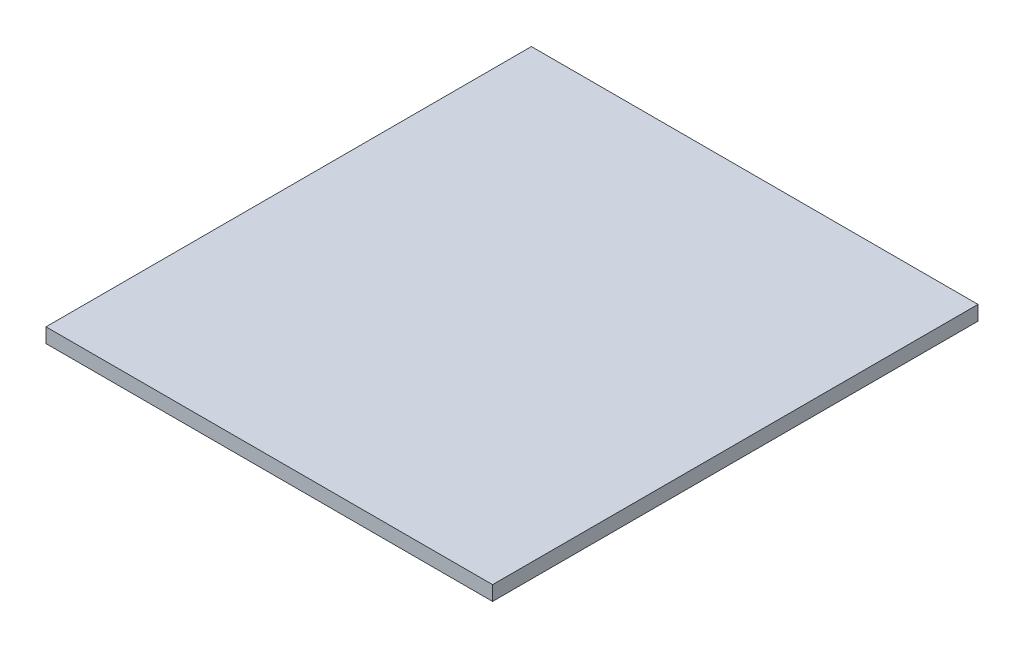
ISO-10303-21;
HEADER;
FILE_DESCRIPTION(('STEP AP214'),'2;1');
FILE_NAME('part.step','',(''),(''),'','','');
FILE_SCHEMA(('AUTOMOTIVE_DESIGN { 1 0 10303 214 1 1 1 1 }'));
ENDSEC;
DATA;
#1=APPLICATION_CONTEXT('core data for automotive mechanical design processes');
#2=APPLICATION_PROTOCOL_DEFINITION('international standard','automotive_design',2000,#1);
#3=PRODUCT_CONTEXT('',#1,'mechanical');
#4=PRODUCT('Part','Part','',(#3));
#5=PRODUCT_RELATED_PRODUCT_CATEGORY('part','',(#4));
#6=PRODUCT_DEFINITION_FORMATION('','',#4);
#7=PRODUCT_DEFINITION_CONTEXT('part definition',#1,'design');
#8=PRODUCT_DEFINITION('design','',#6,#7);
#9=PRODUCT_DEFINITION_SHAPE('','',#8);
#10=(LENGTH_UNIT() NAMED_UNIT(*) SI_UNIT(.MILLI.,.METRE.));
#11=(NAMED_UNIT(*) PLANE_ANGLE_UNIT() SI_UNIT($,.RADIAN.));
#12=(NAMED_UNIT(*) SI_UNIT($,.STERADIAN.) SOLID_ANGLE_UNIT());
#13=UNCERTAINTY_MEASURE_WITH_UNIT(LENGTH_MEASURE(1.E-05),#10,'distance_accuracy_value','');
#14=(GEOMETRIC_REPRESENTATION_CONTEXT(3) GLOBAL_UNCERTAINTY_ASSIGNED_CONTEXT((#13)) GLOBAL_UNIT_ASSIGNED_CONTEXT((#10,
#11,#12)) REPRESENTATION_CONTEXT('',''));
#15=CARTESIAN_POINT('',(0.,0.,0.));
#16=DIRECTION('',(0.,0.,1.));
#17=DIRECTION('',(1.,0.,0.));
#18=AXIS2_PLACEMENT_3D('',#15,#16,#17);
#19=CARTESIAN_POINT('',(-46.,3.,50.));
#20=DIRECTION('',(1.,0.,0.));
#21=DIRECTION('',(0.,0.,-1.));
#22=AXIS2_PLACEMENT_3D('',#19,#20,#21);
#23=PLANE('',#22);
#24=DIRECTION('',(0.,0.,1.));
#25=VECTOR('',#24,1.);
#26=CARTESIAN_POINT('',(-46.,0.,50.));
#27=LINE('',#26,#25);
#28=CARTESIAN_POINT('',(-46.,0.,-50.));
#29=VERTEX_POINT('',#28);
#30=CARTESIAN_POINT('',(-46.,0.,50.));
#31=VERTEX_POINT('',#30);
#32=EDGE_CURVE('E96',#29,#31,#27,.T.);
#33=ORIENTED_EDGE('',*,*,#32,.T.);
#34=DIRECTION('',(0.,-1.,0.));
#35=VECTOR('',#34,1.);
#36=CARTESIAN_POINT('',(-46.,3.,50.));
#37=LINE('',#36,#35);
#38=CARTESIAN_POINT('',(-46.,3.,50.));
#39=VERTEX_POINT('',#38);
#40=EDGE_CURVE('E11',#39,#31,#37,.T.);
#41=ORIENTED_EDGE('',*,*,#40,.F.);
#42=DIRECTION('',(0.,0.,1.));
#43=VECTOR('',#42,1.);
#44=CARTESIAN_POINT('',(-46.,3.,50.));
#45=LINE('',#44,#43);
#46=CARTESIAN_POINT('',(-46.,3.,-50.));
#47=VERTEX_POINT('',#46);
#48=EDGE_CURVE('E84',#47,#39,#45,.T.);
#49=ORIENTED_EDGE('',*,*,#48,.F.);
#50=DIRECTION('',(0.,-1.,0.));
#51=VECTOR('',#50,1.);
#52=CARTESIAN_POINT('',(-46.,3.,-50.));
#53=LINE('',#52,#51);
#54=EDGE_CURVE('E92',#47,#29,#53,.T.);
#55=ORIENTED_EDGE('',*,*,#54,.T.);
#56=EDGE_LOOP('',(#33,#41,#49,#55));
#57=FACE_BOUND('',#56,.T.);
#58=ADVANCED_FACE('F33',(#57),#23,.F.);
#59=CARTESIAN_POINT('',(46.,3.,50.));
#60=DIRECTION('',(0.,0.,-1.));
#61=DIRECTION('',(-1.,0.,0.));
#62=AXIS2_PLACEMENT_3D('',#59,#60,#61);
#63=PLANE('',#62);
#64=DIRECTION('',(1.,0.,0.));
#65=VECTOR('',#64,1.);
#66=CARTESIAN_POINT('',(46.,0.,50.));
#67=LINE('',#66,#65);
#68=CARTESIAN_POINT('',(46.,0.,50.));
#69=VERTEX_POINT('',#68);
#70=EDGE_CURVE('E88',#31,#69,#67,.T.);
#71=ORIENTED_EDGE('',*,*,#70,.T.);
#72=DIRECTION('',(0.,-1.,0.));
#73=VECTOR('',#72,1.);
#74=CARTESIAN_POINT('',(46.,3.,50.));
#75=LINE('',#74,#73);
#76=CARTESIAN_POINT('',(46.,3.,50.));
#77=VERTEX_POINT('',#76);
#78=EDGE_CURVE('E41',#77,#69,#75,.T.);
#79=ORIENTED_EDGE('',*,*,#78,.F.);
#80=DIRECTION('',(1.,0.,0.));
#81=VECTOR('',#80,1.);
#82=CARTESIAN_POINT('',(46.,3.,50.));
#83=LINE('',#82,#81);
#84=EDGE_CURVE('E79',#39,#77,#83,.T.);
#85=ORIENTED_EDGE('',*,*,#84,.F.);
#86=ORIENTED_EDGE('',*,*,#40,.T.);
#87=EDGE_LOOP('',(#71,#79,#85,#86));
#88=FACE_BOUND('',#87,.T.);
#89=ADVANCED_FACE('F87',(#88),#63,.F.);
#90=CARTESIAN_POINT('',(46.,3.,50.));
#91=DIRECTION('',(-1.,0.,0.));
#92=DIRECTION('',(0.,0.,1.));
#93=AXIS2_PLACEMENT_3D('',#90,#91,#92);
#94=PLANE('',#93);
#95=DIRECTION('',(0.,0.,-1.));
#96=VECTOR('',#95,1.);
#97=CARTESIAN_POINT('',(46.,0.,50.));
#98=LINE('',#97,#96);
#99=CARTESIAN_POINT('',(46.,0.,-50.));
#100=VERTEX_POINT('',#99);
#101=EDGE_CURVE('E66',#69,#100,#98,.T.);
#102=ORIENTED_EDGE('',*,*,#101,.T.);
#103=DIRECTION('',(0.,-1.,0.));
#104=VECTOR('',#103,1.);
#105=CARTESIAN_POINT('',(46.,3.,-50.));
#106=LINE('',#105,#104);
#107=CARTESIAN_POINT('',(46.,3.,-50.));
#108=VERTEX_POINT('',#107);
#109=EDGE_CURVE('E89',#108,#100,#106,.T.);
#110=ORIENTED_EDGE('',*,*,#109,.F.);
#111=DIRECTION('',(0.,0.,-1.));
#112=VECTOR('',#111,1.);
#113=CARTESIAN_POINT('',(46.,3.,50.));
#114=LINE('',#113,#112);
#115=EDGE_CURVE('E82',#77,#108,#114,.T.);
#116=ORIENTED_EDGE('',*,*,#115,.F.);
#117=ORIENTED_EDGE('',*,*,#78,.T.);
#118=EDGE_LOOP('',(#102,#110,#116,#117));
#119=FACE_BOUND('',#118,.T.);
#120=ADVANCED_FACE('F90',(#119),#94,.F.);
#121=CARTESIAN_POINT('',(46.,3.,-50.));
#122=DIRECTION('',(0.,0.,1.));
#123=DIRECTION('',(1.,0.,0.));
#124=AXIS2_PLACEMENT_3D('',#121,#122,#123);
#125=PLANE('',#124);
#126=DIRECTION('',(-1.,0.,0.));
#127=VECTOR('',#126,1.);
#128=CARTESIAN_POINT('',(46.,0.,-50.));
#129=LINE('',#128,#127);
#130=EDGE_CURVE('E72',#100,#29,#129,.T.);
#131=ORIENTED_EDGE('',*,*,#130,.T.);
#132=ORIENTED_EDGE('',*,*,#54,.F.);
#133=DIRECTION('',(-1.,0.,0.));
#134=VECTOR('',#133,1.);
#135=CARTESIAN_POINT('',(46.,3.,-50.));
#136=LINE('',#135,#134);
#137=EDGE_CURVE('E49',#108,#47,#136,.T.);
#138=ORIENTED_EDGE('',*,*,#137,.F.);
#139=ORIENTED_EDGE('',*,*,#109,.T.);
#140=EDGE_LOOP('',(#131,#132,#138,#139));
#141=FACE_BOUND('',#140,.T.);
#142=ADVANCED_FACE('F103',(#141),#125,.F.);
#143=CARTESIAN_POINT('',(0.,3.,0.));
#144=DIRECTION('',(0.,1.,0.));
#145=DIRECTION('',(0.,0.,1.));
#146=AXIS2_PLACEMENT_3D('',#143,#144,#145);
#147=PLANE('',#146);
#148=ORIENTED_EDGE('',*,*,#48,.T.);
#149=ORIENTED_EDGE('',*,*,#84,.T.);
#150=ORIENTED_EDGE('',*,*,#115,.T.);
#151=ORIENTED_EDGE('',*,*,#137,.T.);
#152=EDGE_LOOP('',(#148,#149,#150,#151));
#153=FACE_BOUND('',#152,.T.);
#154=ADVANCED_FACE('F80',(#153),#147,.T.);
#155=CARTESIAN_POINT('',(0.,0.,0.));
#156=DIRECTION('',(0.,1.,0.));
#157=DIRECTION('',(0.,0.,1.));
#158=AXIS2_PLACEMENT_3D('',#155,#156,#157);
#159=PLANE('',#158);
#160=ORIENTED_EDGE('',*,*,#32,.F.);
#161=ORIENTED_EDGE('',*,*,#130,.F.);
#162=ORIENTED_EDGE('',*,*,#101,.F.);
#163=ORIENTED_EDGE('',*,*,#70,.F.);
#164=EDGE_LOOP('',(#160,#161,#162,#163));
#165=FACE_BOUND('',#164,.T.);
#166=ADVANCED_FACE('F106',(#165),#159,.F.);
#167=CLOSED_SHELL('',(#58,#89,#120,#142,#154,#166));
#168=MANIFOLD_SOLID_BREP('B2',#167);
#169=ADVANCED_BREP_SHAPE_REPRESENTATION('',(#18,#168),#14);
#170=SHAPE_DEFINITION_REPRESENTATION(#9,#169);
ENDSEC;
END-ISO-10303-21;
